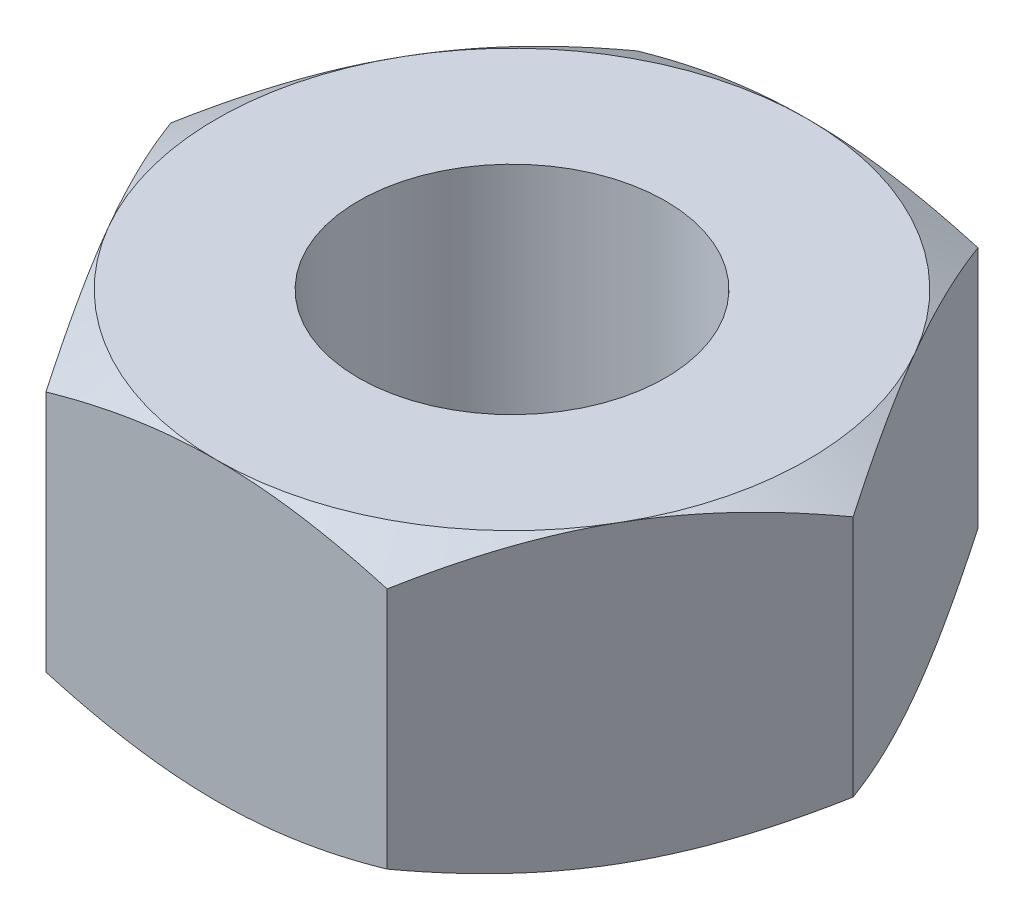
from build123d import *

# Parameters (mm, degrees)
EXTRUSION1_DEPTH        = 3.25
ESQUISSE3_R             = 3.375
ENL_V_MAT_EXTRU_1_DEPTH = 12.867322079


with BuildPart() as part:
    # Esquisse1 → Extrusion1 (new, symmetric)
    with BuildSketch(Plane(origin=(0, 0, 0), x_dir=(1, 0, 0), z_dir=(0, 1, 0))):
        Polygon((7.505553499, 0), (3.75277675, 6.5), (-3.75277675, 6.5), (-7.505553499, 0), (-3.75277675, -6.5), (3.75277675, -6.5), align=None)
    extrude(amount=EXTRUSION1_DEPTH, both=True)

    # Esquisse2 → Enl_vement de mati_re-R_volution4 (revolve, cut)
    with BuildSketch(Plane(origin=(0, 0, 0), x_dir=(0, 0, -1), z_dir=(1, 0, 0))):
        Polygon((3.5, 4.982050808), (9.5, 4.982050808), (9.5, 1.517949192), align=None)
    enl_vement_de_mati_re_r_volution4 = revolve(axis=Axis((0, 9.378046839, 0), (0, -1, 0)), mode=Mode.SUBTRACT)

    # Sym_trie1: Enl_vement de mati_re-R_volution4 across plane
    add(enl_vement_de_mati_re_r_volution4.mirror(Plane.ZX), mode=Mode.SUBTRACT)

    # Esquisse3 → Enl_v. mat.-Extru.1 (cut, through all)
    with BuildSketch(Plane(origin=(0, 3.25, 0), x_dir=(-1, 0, 0), z_dir=(0, 1, 0))):
        with Locations(Location((0, 0, 0), (0, 0, 90))):
            Circle(ESQUISSE3_R)
    extrude(amount=-ENL_V_MAT_EXTRU_1_DEPTH, mode=Mode.SUBTRACT)


solid = part.part
